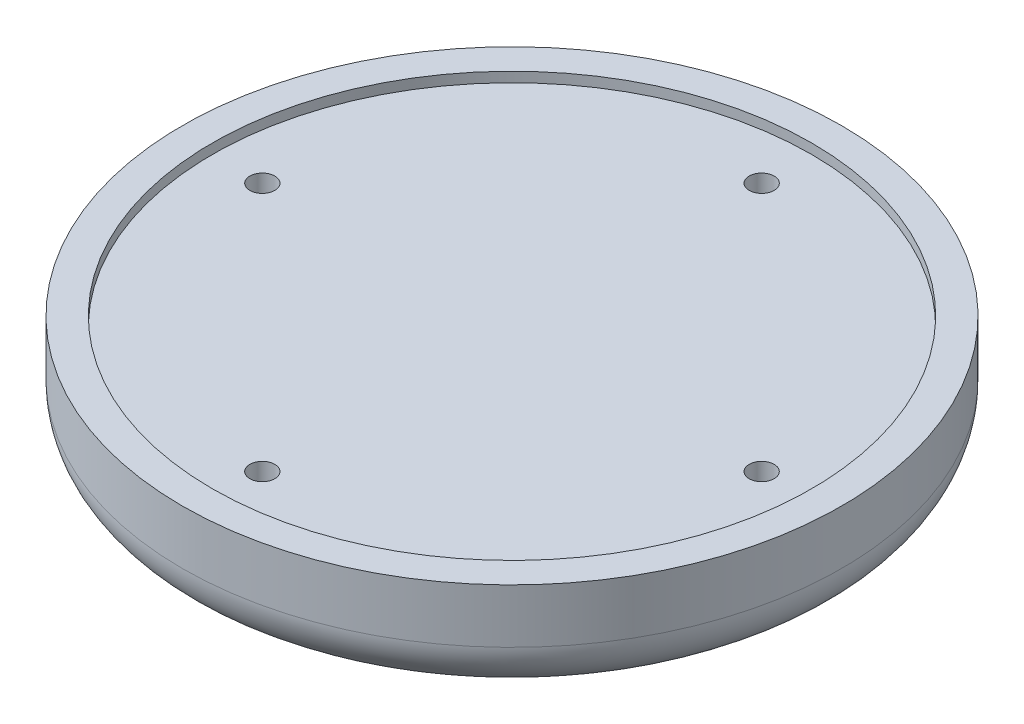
ISO-10303-21;
HEADER;
FILE_DESCRIPTION(('STEP AP214'),'2;1');
FILE_NAME('part.step','',(''),(''),'','','');
FILE_SCHEMA(('AUTOMOTIVE_DESIGN { 1 0 10303 214 1 1 1 1 }'));
ENDSEC;
DATA;
#1=APPLICATION_CONTEXT('core data for automotive mechanical design processes');
#2=APPLICATION_PROTOCOL_DEFINITION('international standard','automotive_design',2000,#1);
#3=PRODUCT_CONTEXT('',#1,'mechanical');
#4=PRODUCT('Part','Part','',(#3));
#5=PRODUCT_RELATED_PRODUCT_CATEGORY('part','',(#4));
#6=PRODUCT_DEFINITION_FORMATION('','',#4);
#7=PRODUCT_DEFINITION_CONTEXT('part definition',#1,'design');
#8=PRODUCT_DEFINITION('design','',#6,#7);
#9=PRODUCT_DEFINITION_SHAPE('','',#8);
#10=(LENGTH_UNIT() NAMED_UNIT(*) SI_UNIT(.MILLI.,.METRE.));
#11=(NAMED_UNIT(*) PLANE_ANGLE_UNIT() SI_UNIT($,.RADIAN.));
#12=(NAMED_UNIT(*) SI_UNIT($,.STERADIAN.) SOLID_ANGLE_UNIT());
#13=UNCERTAINTY_MEASURE_WITH_UNIT(LENGTH_MEASURE(1.E-05),#10,'distance_accuracy_value','');
#14=(GEOMETRIC_REPRESENTATION_CONTEXT(3) GLOBAL_UNCERTAINTY_ASSIGNED_CONTEXT((#13)) GLOBAL_UNIT_ASSIGNED_CONTEXT((#10,
#11,#12)) REPRESENTATION_CONTEXT('',''));
#15=CARTESIAN_POINT('',(0.,0.,0.));
#16=DIRECTION('',(0.,0.,1.));
#17=DIRECTION('',(1.,0.,0.));
#18=AXIS2_PLACEMENT_3D('',#15,#16,#17);
#19=CARTESIAN_POINT('',(-24.9999999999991,-5.,8.78072607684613E-13));
#20=DIRECTION('',(0.,1.,0.));
#21=DIRECTION('',(0.,0.,1.));
#22=AXIS2_PLACEMENT_3D('',#19,#20,#21);
#23=CYLINDRICAL_SURFACE('',#22,1.25);
#24=CARTESIAN_POINT('',(-24.9999999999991,-2.,8.78072607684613E-13));
#25=DIRECTION('',(0.,-1.,0.));
#26=DIRECTION('',(0.,0.,-1.));
#27=AXIS2_PLACEMENT_3D('',#24,#25,#26);
#28=CIRCLE('',#27,1.25);
#29=CARTESIAN_POINT('',(-24.9999999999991,-2.,-1.24999999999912));
#30=VERTEX_POINT('',#29);
#31=EDGE_CURVE('E42',#30,#30,#28,.F.);
#32=ORIENTED_EDGE('',*,*,#31,.F.);
#33=EDGE_LOOP('',(#32));
#34=FACE_BOUND('',#33,.T.);
#35=CARTESIAN_POINT('',(-24.9999999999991,4.,8.78072607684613E-13));
#36=DIRECTION('',(0.,1.,0.));
#37=DIRECTION('',(0.,0.,1.));
#38=AXIS2_PLACEMENT_3D('',#35,#36,#37);
#39=CIRCLE('',#38,1.25);
#40=CARTESIAN_POINT('',(-24.9999999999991,4.,1.25000000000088));
#41=VERTEX_POINT('',#40);
#42=EDGE_CURVE('E74',#41,#41,#39,.F.);
#43=ORIENTED_EDGE('',*,*,#42,.F.);
#44=EDGE_LOOP('',(#43));
#45=FACE_BOUND('',#44,.T.);
#46=ADVANCED_FACE('F31',(#34,#45),#23,.F.);
#47=CARTESIAN_POINT('',(0.,-5.,-25.));
#48=DIRECTION('',(0.,1.,0.));
#49=DIRECTION('',(0.,0.,1.));
#50=AXIS2_PLACEMENT_3D('',#47,#48,#49);
#51=CYLINDRICAL_SURFACE('',#50,1.25);
#52=CARTESIAN_POINT('',(0.,-2.,-25.));
#53=DIRECTION('',(0.,-1.,0.));
#54=DIRECTION('',(0.,0.,-1.));
#55=AXIS2_PLACEMENT_3D('',#52,#53,#54);
#56=CIRCLE('',#55,1.25);
#57=CARTESIAN_POINT('',(0.,-2.,-26.25));
#58=VERTEX_POINT('',#57);
#59=EDGE_CURVE('E47',#58,#58,#56,.F.);
#60=ORIENTED_EDGE('',*,*,#59,.F.);
#61=EDGE_LOOP('',(#60));
#62=FACE_BOUND('',#61,.T.);
#63=CARTESIAN_POINT('',(0.,4.,-25.));
#64=DIRECTION('',(0.,1.,0.));
#65=DIRECTION('',(0.,0.,1.));
#66=AXIS2_PLACEMENT_3D('',#63,#64,#65);
#67=CIRCLE('',#66,1.25);
#68=CARTESIAN_POINT('',(0.,4.,-23.75));
#69=VERTEX_POINT('',#68);
#70=EDGE_CURVE('E62',#69,#69,#67,.F.);
#71=ORIENTED_EDGE('',*,*,#70,.F.);
#72=EDGE_LOOP('',(#71));
#73=FACE_BOUND('',#72,.T.);
#74=ADVANCED_FACE('F89',(#62,#73),#51,.F.);
#75=CARTESIAN_POINT('',(25.0000000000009,-5.,-8.75010990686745E-13));
#76=DIRECTION('',(0.,1.,0.));
#77=DIRECTION('',(0.,0.,1.));
#78=AXIS2_PLACEMENT_3D('',#75,#76,#77);
#79=CYLINDRICAL_SURFACE('',#78,1.25);
#80=CARTESIAN_POINT('',(25.0000000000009,-2.,-8.75010990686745E-13));
#81=DIRECTION('',(0.,-1.,0.));
#82=DIRECTION('',(0.,0.,-1.));
#83=AXIS2_PLACEMENT_3D('',#80,#81,#82);
#84=CIRCLE('',#83,1.25);
#85=CARTESIAN_POINT('',(25.0000000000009,-2.,-1.25000000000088));
#86=VERTEX_POINT('',#85);
#87=EDGE_CURVE('E53',#86,#86,#84,.F.);
#88=ORIENTED_EDGE('',*,*,#87,.F.);
#89=EDGE_LOOP('',(#88));
#90=FACE_BOUND('',#89,.T.);
#91=CARTESIAN_POINT('',(25.0000000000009,4.,-8.75010990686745E-13));
#92=DIRECTION('',(0.,1.,0.));
#93=DIRECTION('',(0.,0.,1.));
#94=AXIS2_PLACEMENT_3D('',#91,#92,#93);
#95=CIRCLE('',#94,1.25);
#96=CARTESIAN_POINT('',(25.0000000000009,4.,1.24999999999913));
#97=VERTEX_POINT('',#96);
#98=EDGE_CURVE('E57',#97,#97,#95,.F.);
#99=ORIENTED_EDGE('',*,*,#98,.F.);
#100=EDGE_LOOP('',(#99));
#101=FACE_BOUND('',#100,.T.);
#102=ADVANCED_FACE('F92',(#90,#101),#79,.F.);
#103=CARTESIAN_POINT('',(1.75002198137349E-12,-5.,25.));
#104=DIRECTION('',(0.,1.,0.));
#105=DIRECTION('',(0.,0.,1.));
#106=AXIS2_PLACEMENT_3D('',#103,#104,#105);
#107=CYLINDRICAL_SURFACE('',#106,1.25);
#108=CARTESIAN_POINT('',(1.75002198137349E-12,-2.,25.));
#109=DIRECTION('',(0.,-1.,0.));
#110=DIRECTION('',(0.,0.,-1.));
#111=AXIS2_PLACEMENT_3D('',#108,#109,#110);
#112=CIRCLE('',#111,1.25);
#113=CARTESIAN_POINT('',(1.75002198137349E-12,-2.,23.75));
#114=VERTEX_POINT('',#113);
#115=EDGE_CURVE('E51',#114,#114,#112,.F.);
#116=ORIENTED_EDGE('',*,*,#115,.F.);
#117=EDGE_LOOP('',(#116));
#118=FACE_BOUND('',#117,.T.);
#119=CARTESIAN_POINT('',(1.75002198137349E-12,4.,25.));
#120=DIRECTION('',(0.,1.,0.));
#121=DIRECTION('',(0.,0.,1.));
#122=AXIS2_PLACEMENT_3D('',#119,#120,#121);
#123=CIRCLE('',#122,1.25);
#124=CARTESIAN_POINT('',(1.75002198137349E-12,4.,26.25));
#125=VERTEX_POINT('',#124);
#126=EDGE_CURVE('E55',#125,#125,#123,.F.);
#127=ORIENTED_EDGE('',*,*,#126,.F.);
#128=EDGE_LOOP('',(#127));
#129=FACE_BOUND('',#128,.T.);
#130=ADVANCED_FACE('F117',(#118,#129),#107,.F.);
#131=CARTESIAN_POINT('',(0.,-5.,0.));
#132=DIRECTION('',(0.,1.,0.));
#133=DIRECTION('',(0.,0.,1.));
#134=AXIS2_PLACEMENT_3D('',#131,#132,#133);
#135=CYLINDRICAL_SURFACE('',#134,33.);
#136=CARTESIAN_POINT('',(0.,-0.417424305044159,0.));
#137=DIRECTION('',(0.,-1.,0.));
#138=DIRECTION('',(0.,0.,-1.));
#139=AXIS2_PLACEMENT_3D('',#136,#137,#138);
#140=CIRCLE('',#139,33.);
#141=CARTESIAN_POINT('',(0.,-0.417424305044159,-33.));
#142=VERTEX_POINT('',#141);
#143=EDGE_CURVE('E10',#142,#142,#140,.F.);
#144=ORIENTED_EDGE('',*,*,#143,.T.);
#145=EDGE_LOOP('',(#144));
#146=FACE_BOUND('',#145,.T.);
#147=CARTESIAN_POINT('',(0.,5.,0.));
#148=DIRECTION('',(0.,1.,0.));
#149=DIRECTION('',(0.,0.,1.));
#150=AXIS2_PLACEMENT_3D('',#147,#148,#149);
#151=CIRCLE('',#150,33.);
#152=CARTESIAN_POINT('',(0.,5.,33.));
#153=VERTEX_POINT('',#152);
#154=EDGE_CURVE('E38',#153,#153,#151,.T.);
#155=ORIENTED_EDGE('',*,*,#154,.F.);
#156=EDGE_LOOP('',(#155));
#157=FACE_BOUND('',#156,.T.);
#158=ADVANCED_FACE('F114',(#146,#157),#135,.T.);
#159=CARTESIAN_POINT('',(0.,5.,0.));
#160=DIRECTION('',(0.,1.,0.));
#161=DIRECTION('',(0.,0.,1.));
#162=AXIS2_PLACEMENT_3D('',#159,#160,#161);
#163=PLANE('',#162);
#164=CARTESIAN_POINT('',(0.,5.,0.));
#165=DIRECTION('',(0.,1.,0.));
#166=DIRECTION('',(0.,0.,1.));
#167=AXIS2_PLACEMENT_3D('',#164,#165,#166);
#168=CIRCLE('',#167,30.);
#169=CARTESIAN_POINT('',(0.,5.,30.));
#170=VERTEX_POINT('',#169);
#171=EDGE_CURVE('E65',#170,#170,#168,.T.);
#172=ORIENTED_EDGE('',*,*,#171,.F.);
#173=EDGE_LOOP('',(#172));
#174=FACE_BOUND('',#173,.T.);
#175=ORIENTED_EDGE('',*,*,#154,.T.);
#176=EDGE_LOOP('',(#175));
#177=FACE_BOUND('',#176,.T.);
#178=ADVANCED_FACE('F112',(#174,#177),#163,.T.);
#179=CARTESIAN_POINT('',(0.,-2.,0.));
#180=DIRECTION('',(0.,-1.,0.));
#181=DIRECTION('',(0.,0.,-1.));
#182=AXIS2_PLACEMENT_3D('',#179,#180,#181);
#183=PLANE('',#182);
#184=CARTESIAN_POINT('',(0.,-2.,0.));
#185=DIRECTION('',(0.,-1.,0.));
#186=DIRECTION('',(0.,0.,-1.));
#187=AXIS2_PLACEMENT_3D('',#184,#185,#186);
#188=CIRCLE('',#187,30.);
#189=CARTESIAN_POINT('',(0.,-2.,-30.));
#190=VERTEX_POINT('',#189);
#191=EDGE_CURVE('E54',#190,#190,#188,.T.);
#192=ORIENTED_EDGE('',*,*,#191,.T.);
#193=EDGE_LOOP('',(#192));
#194=FACE_BOUND('',#193,.T.);
#195=ORIENTED_EDGE('',*,*,#115,.T.);
#196=EDGE_LOOP('',(#195));
#197=FACE_BOUND('',#196,.T.);
#198=ORIENTED_EDGE('',*,*,#87,.T.);
#199=EDGE_LOOP('',(#198));
#200=FACE_BOUND('',#199,.T.);
#201=ORIENTED_EDGE('',*,*,#59,.T.);
#202=EDGE_LOOP('',(#201));
#203=FACE_BOUND('',#202,.T.);
#204=ORIENTED_EDGE('',*,*,#31,.T.);
#205=EDGE_LOOP('',(#204));
#206=FACE_BOUND('',#205,.T.);
#207=ADVANCED_FACE('F86',(#194,#197,#200,#203,#206),#183,.T.);
#208=CARTESIAN_POINT('',(0.,-2.,0.));
#209=DIRECTION('',(0.,-1.,0.));
#210=DIRECTION('',(0.,0.,-1.));
#211=AXIS2_PLACEMENT_3D('',#208,#209,#210);
#212=CYLINDRICAL_SURFACE('',#211,30.);
#213=ORIENTED_EDGE('',*,*,#191,.F.);
#214=EDGE_LOOP('',(#213));
#215=FACE_BOUND('',#214,.T.);
#216=CARTESIAN_POINT('',(0.,-5.,0.));
#217=DIRECTION('',(0.,-1.,0.));
#218=DIRECTION('',(0.,0.,-1.));
#219=AXIS2_PLACEMENT_3D('',#216,#217,#218);
#220=CIRCLE('',#219,30.);
#221=CARTESIAN_POINT('',(0.,-5.,-30.));
#222=VERTEX_POINT('',#221);
#223=EDGE_CURVE('E77',#222,#222,#220,.T.);
#224=ORIENTED_EDGE('',*,*,#223,.T.);
#225=EDGE_LOOP('',(#224));
#226=FACE_BOUND('',#225,.T.);
#227=ADVANCED_FACE('F100',(#215,#226),#212,.F.);
#228=CARTESIAN_POINT('',(0.,4.,0.));
#229=DIRECTION('',(0.,1.,0.));
#230=DIRECTION('',(0.,0.,1.));
#231=AXIS2_PLACEMENT_3D('',#228,#229,#230);
#232=PLANE('',#231);
#233=CARTESIAN_POINT('',(0.,4.,0.));
#234=DIRECTION('',(0.,1.,0.));
#235=DIRECTION('',(0.,0.,1.));
#236=AXIS2_PLACEMENT_3D('',#233,#234,#235);
#237=CIRCLE('',#236,30.);
#238=CARTESIAN_POINT('',(0.,4.,30.));
#239=VERTEX_POINT('',#238);
#240=EDGE_CURVE('E58',#239,#239,#237,.T.);
#241=ORIENTED_EDGE('',*,*,#240,.T.);
#242=EDGE_LOOP('',(#241));
#243=FACE_BOUND('',#242,.T.);
#244=ORIENTED_EDGE('',*,*,#126,.T.);
#245=EDGE_LOOP('',(#244));
#246=FACE_BOUND('',#245,.T.);
#247=ORIENTED_EDGE('',*,*,#98,.T.);
#248=EDGE_LOOP('',(#247));
#249=FACE_BOUND('',#248,.T.);
#250=ORIENTED_EDGE('',*,*,#70,.T.);
#251=EDGE_LOOP('',(#250));
#252=FACE_BOUND('',#251,.T.);
#253=ORIENTED_EDGE('',*,*,#42,.T.);
#254=EDGE_LOOP('',(#253));
#255=FACE_BOUND('',#254,.T.);
#256=ADVANCED_FACE('F96',(#243,#246,#249,#252,#255),#232,.T.);
#257=CARTESIAN_POINT('',(0.,4.,0.));
#258=DIRECTION('',(0.,1.,0.));
#259=DIRECTION('',(0.,0.,1.));
#260=AXIS2_PLACEMENT_3D('',#257,#258,#259);
#261=CYLINDRICAL_SURFACE('',#260,30.);
#262=ORIENTED_EDGE('',*,*,#240,.F.);
#263=EDGE_LOOP('',(#262));
#264=FACE_BOUND('',#263,.T.);
#265=ORIENTED_EDGE('',*,*,#171,.T.);
#266=EDGE_LOOP('',(#265));
#267=FACE_BOUND('',#266,.T.);
#268=ADVANCED_FACE('F99',(#264,#267),#261,.F.);
#269=CARTESIAN_POINT('',(0.,-0.417424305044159,0.));
#270=DIRECTION('',(0.,-1.,0.));
#271=DIRECTION('',(0.,0.,-1.));
#272=AXIS2_PLACEMENT_3D('',#269,#270,#271);
#273=TOROIDAL_SURFACE('',#272,28.,5.);
#274=ORIENTED_EDGE('',*,*,#223,.F.);
#275=EDGE_LOOP('',(#274));
#276=FACE_BOUND('',#275,.T.);
#277=ORIENTED_EDGE('',*,*,#143,.F.);
#278=EDGE_LOOP('',(#277));
#279=FACE_BOUND('',#278,.T.);
#280=ADVANCED_FACE('F33',(#276,#279),#273,.T.);
#281=CLOSED_SHELL('',(#46,#74,#102,#130,#158,#178,#207,#227,#256,#268,#280));
#282=MANIFOLD_SOLID_BREP('B2',#281);
#283=ADVANCED_BREP_SHAPE_REPRESENTATION('',(#18,#282),#14);
#284=SHAPE_DEFINITION_REPRESENTATION(#9,#283);
ENDSEC;
END-ISO-10303-21;
